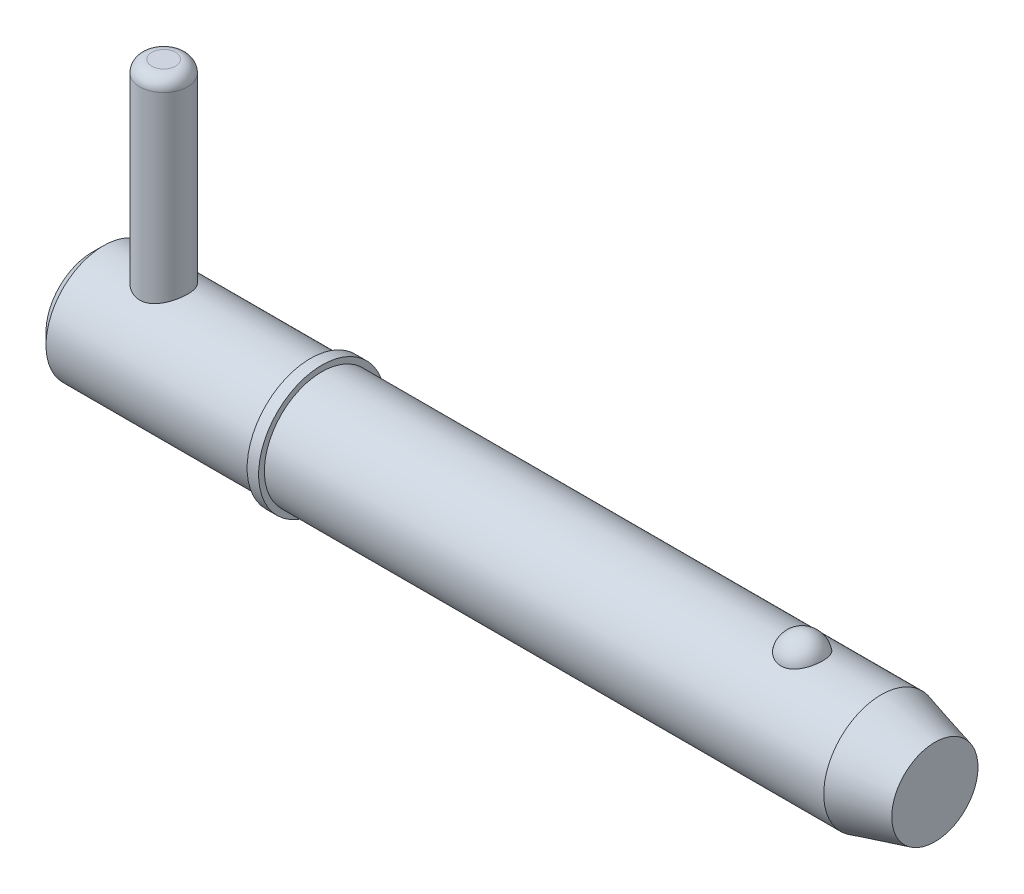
ISO-10303-21;
HEADER;
FILE_DESCRIPTION(('STEP AP214'),'2;1');
FILE_NAME('part.step','',(''),(''),'','','');
FILE_SCHEMA(('AUTOMOTIVE_DESIGN { 1 0 10303 214 1 1 1 1 }'));
ENDSEC;
DATA;
#1=APPLICATION_CONTEXT('core data for automotive mechanical design processes');
#2=APPLICATION_PROTOCOL_DEFINITION('international standard','automotive_design',2000,#1);
#3=PRODUCT_CONTEXT('',#1,'mechanical');
#4=PRODUCT('Part','Part','',(#3));
#5=PRODUCT_RELATED_PRODUCT_CATEGORY('part','',(#4));
#6=PRODUCT_DEFINITION_FORMATION('','',#4);
#7=PRODUCT_DEFINITION_CONTEXT('part definition',#1,'design');
#8=PRODUCT_DEFINITION('design','',#6,#7);
#9=PRODUCT_DEFINITION_SHAPE('','',#8);
#10=(LENGTH_UNIT() NAMED_UNIT(*) SI_UNIT(.MILLI.,.METRE.));
#11=(NAMED_UNIT(*) PLANE_ANGLE_UNIT() SI_UNIT($,.RADIAN.));
#12=(NAMED_UNIT(*) SI_UNIT($,.STERADIAN.) SOLID_ANGLE_UNIT());
#13=UNCERTAINTY_MEASURE_WITH_UNIT(LENGTH_MEASURE(1.E-05),#10,'distance_accuracy_value','');
#14=(GEOMETRIC_REPRESENTATION_CONTEXT(3) GLOBAL_UNCERTAINTY_ASSIGNED_CONTEXT((#13)) GLOBAL_UNIT_ASSIGNED_CONTEXT((#10,
#11,#12)) REPRESENTATION_CONTEXT('',''));
#15=CARTESIAN_POINT('',(0.,0.,0.));
#16=DIRECTION('',(0.,0.,1.));
#17=DIRECTION('',(1.,0.,0.));
#18=AXIS2_PLACEMENT_3D('',#15,#16,#17);
#19=CARTESIAN_POINT('',(5.94,20.635,0.));
#20=DIRECTION('',(0.,-1.,0.));
#21=DIRECTION('',(0.,0.,-1.));
#22=AXIS2_PLACEMENT_3D('',#19,#20,#21);
#23=CYLINDRICAL_SURFACE('',#22,1.98);
#24=CARTESIAN_POINT('',(5.94,-3.775,0.));
#25=DIRECTION('',(0.,1.,0.));
#26=DIRECTION('',(0.,0.,1.));
#27=AXIS2_PLACEMENT_3D('',#24,#25,#26);
#28=CIRCLE('',#27,1.98);
#29=CARTESIAN_POINT('',(5.94,-3.775,1.98));
#30=VERTEX_POINT('',#29);
#31=EDGE_CURVE('P0_E25',#30,#30,#28,.T.);
#32=ORIENTED_EDGE('',*,*,#31,.T.);
#33=EDGE_LOOP('',(#32));
#34=FACE_BOUND('',#33,.T.);
#35=CARTESIAN_POINT('',(5.94,19.645,0.));
#36=DIRECTION('',(0.,1.,0.));
#37=DIRECTION('',(0.,0.,1.));
#38=AXIS2_PLACEMENT_3D('',#35,#36,#37);
#39=CIRCLE('',#38,1.98);
#40=CARTESIAN_POINT('',(5.94,19.645,1.98));
#41=VERTEX_POINT('',#40);
#42=EDGE_CURVE('P0_E29',#41,#41,#39,.F.);
#43=ORIENTED_EDGE('',*,*,#42,.T.);
#44=EDGE_LOOP('',(#43));
#45=FACE_BOUND('',#44,.T.);
#46=ADVANCED_FACE('P0_F14',(#34,#45),#23,.T.);
#47=CARTESIAN_POINT('',(5.94,20.635,0.));
#48=DIRECTION('',(0.,1.,0.));
#49=DIRECTION('',(0.,0.,1.));
#50=AXIS2_PLACEMENT_3D('',#47,#48,#49);
#51=PLANE('',#50);
#52=CARTESIAN_POINT('',(5.94,20.635,0.));
#53=DIRECTION('',(0.,1.,0.));
#54=DIRECTION('',(0.,0.,1.));
#55=AXIS2_PLACEMENT_3D('',#52,#53,#54);
#56=CIRCLE('',#55,0.99);
#57=CARTESIAN_POINT('',(5.94,20.635,0.99));
#58=VERTEX_POINT('',#57);
#59=EDGE_CURVE('P0_E10',#58,#58,#56,.T.);
#60=ORIENTED_EDGE('',*,*,#59,.T.);
#61=EDGE_LOOP('',(#60));
#62=FACE_BOUND('',#61,.T.);
#63=ADVANCED_FACE('P0_F46',(#62),#51,.T.);
#64=CARTESIAN_POINT('',(5.94,-4.765,0.));
#65=DIRECTION('',(0.,1.,0.));
#66=DIRECTION('',(0.,0.,1.));
#67=AXIS2_PLACEMENT_3D('',#64,#65,#66);
#68=PLANE('',#67);
#69=CARTESIAN_POINT('',(5.94,-4.765,0.));
#70=DIRECTION('',(0.,1.,0.));
#71=DIRECTION('',(0.,0.,1.));
#72=AXIS2_PLACEMENT_3D('',#69,#70,#71);
#73=CIRCLE('',#72,0.99);
#74=CARTESIAN_POINT('',(5.94,-4.765,0.99));
#75=VERTEX_POINT('',#74);
#76=EDGE_CURVE('P0_E21',#75,#75,#73,.F.);
#77=ORIENTED_EDGE('',*,*,#76,.T.);
#78=EDGE_LOOP('',(#77));
#79=FACE_BOUND('',#78,.T.);
#80=ADVANCED_FACE('P0_F43',(#79),#68,.F.);
#81=CARTESIAN_POINT('',(5.94,-3.775,0.));
#82=DIRECTION('',(0.,1.,0.));
#83=DIRECTION('',(0.,0.,1.));
#84=AXIS2_PLACEMENT_3D('',#81,#82,#83);
#85=DEGENERATE_TOROIDAL_SURFACE('',#84,0.99,0.99,.T.);
#86=ORIENTED_EDGE('',*,*,#76,.F.);
#87=EDGE_LOOP('',(#86));
#88=FACE_BOUND('',#87,.T.);
#89=ORIENTED_EDGE('',*,*,#31,.F.);
#90=EDGE_LOOP('',(#89));
#91=FACE_BOUND('',#90,.T.);
#92=ADVANCED_FACE('P0_F38',(#88,#91),#85,.T.);
#93=CARTESIAN_POINT('',(5.94,19.645,0.));
#94=DIRECTION('',(0.,1.,0.));
#95=DIRECTION('',(0.,0.,1.));
#96=AXIS2_PLACEMENT_3D('',#93,#94,#95);
#97=DEGENERATE_TOROIDAL_SURFACE('',#96,0.99,0.99,.T.);
#98=ORIENTED_EDGE('',*,*,#42,.F.);
#99=EDGE_LOOP('',(#98));
#100=FACE_BOUND('',#99,.T.);
#101=ORIENTED_EDGE('',*,*,#59,.F.);
#102=EDGE_LOOP('',(#101));
#103=FACE_BOUND('',#102,.T.);
#104=ADVANCED_FACE('P0_F16',(#100,#103),#97,.T.);
#105=CLOSED_SHELL('',(#46,#63,#80,#92,#104));
#106=MANIFOLD_SOLID_BREP('P0_B1',#105);
#107=CARTESIAN_POINT('',(0.,0.,0.));
#108=DIRECTION('',(1.,0.,0.));
#109=DIRECTION('',(0.,0.,-1.));
#110=AXIS2_PLACEMENT_3D('',#107,#108,#109);
#111=CYLINDRICAL_SURFACE('',#110,4.765);
#112=CARTESIAN_POINT('',(65.4041944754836,0.,0.));
#113=DIRECTION('',(1.,0.,0.));
#114=DIRECTION('',(0.,0.,-1.));
#115=AXIS2_PLACEMENT_3D('',#112,#113,#114);
#116=CIRCLE('',#115,4.765);
#117=CARTESIAN_POINT('',(65.4041944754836,0.,-4.765));
#118=VERTEX_POINT('',#117);
#119=EDGE_CURVE('P1_E81',#118,#118,#116,.T.);
#120=ORIENTED_EDGE('',*,*,#119,.F.);
#121=EDGE_LOOP('',(#120));
#122=FACE_BOUND('',#121,.T.);
#123=CARTESIAN_POINT('',(19.05,0.,0.));
#124=DIRECTION('',(1.,0.,0.));
#125=DIRECTION('',(0.,0.,-1.));
#126=AXIS2_PLACEMENT_3D('',#123,#124,#125);
#127=CIRCLE('',#126,4.765);
#128=CARTESIAN_POINT('',(19.05,0.,-4.765));
#129=VERTEX_POINT('',#128);
#130=EDGE_CURVE('P1_E85',#129,#129,#127,.T.);
#131=ORIENTED_EDGE('',*,*,#130,.T.);
#132=EDGE_LOOP('',(#131));
#133=FACE_BOUND('',#132,.T.);
#134=CARTESIAN_POINT('',(58.851020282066,4.42764777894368,1.76101111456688));
#135=CARTESIAN_POINT('',(58.7597212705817,4.42764470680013,1.76101422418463));
#136=CARTESIAN_POINT('',(58.6684468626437,4.43059091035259,1.75366340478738));
#137=CARTESIAN_POINT('',(58.4886154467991,4.44201846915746,1.72451180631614));
#138=CARTESIAN_POINT('',(58.4000577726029,4.45049845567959,1.70271460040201));
#139=CARTESIAN_POINT('',(58.2282570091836,4.47200516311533,1.64539370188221));
#140=CARTESIAN_POINT('',(58.1450064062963,4.48502527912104,1.60988994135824));
#141=CARTESIAN_POINT('',(57.9857633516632,4.51419542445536,1.52617873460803));
#142=CARTESIAN_POINT('',(57.9097723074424,4.53034605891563,1.47796883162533));
#143=CARTESIAN_POINT('',(57.7647445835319,4.5645931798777,1.36860494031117));
#144=CARTESIAN_POINT('',(57.6959645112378,4.58273170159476,1.3071242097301));
#145=CARTESIAN_POINT('',(57.5693423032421,4.61870302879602,1.17370204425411));
#146=CARTESIAN_POINT('',(57.5115021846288,4.63653577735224,1.10175868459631));
#147=CARTESIAN_POINT('',(57.4055709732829,4.67090140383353,0.945806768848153));
#148=CARTESIAN_POINT('',(57.3580305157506,4.68734068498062,0.861402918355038));
#149=CARTESIAN_POINT('',(57.2770817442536,4.71628466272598,0.685442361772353));
#150=CARTESIAN_POINT('',(57.2436747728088,4.72878898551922,0.593884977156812));
#151=CARTESIAN_POINT('',(57.191287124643,4.74874061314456,0.404781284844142));
#152=CARTESIAN_POINT('',(57.1725178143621,4.75611366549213,0.307168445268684));
#153=CARTESIAN_POINT('',(57.1505846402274,4.76475393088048,0.109940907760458));
#154=CARTESIAN_POINT('',(57.1474205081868,4.76602124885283,0.0103262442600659));
#155=CARTESIAN_POINT('',(57.1567405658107,4.76232928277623,-0.187629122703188));
#156=CARTESIAN_POINT('',(57.1691588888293,4.7573962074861,-0.285973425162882));
#157=CARTESIAN_POINT('',(57.2092804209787,4.74184975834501,-0.479027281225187));
#158=CARTESIAN_POINT('',(57.2369839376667,4.7312362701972,-0.573736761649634));
#159=CARTESIAN_POINT('',(57.3071581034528,4.70540026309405,-0.756973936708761));
#160=CARTESIAN_POINT('',(57.3496460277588,4.69017235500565,-0.845494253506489));
#161=CARTESIAN_POINT('',(57.448520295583,4.6566986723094,-1.01378033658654));
#162=CARTESIAN_POINT('',(57.5049076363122,4.63845268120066,-1.09354547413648));
#163=CARTESIAN_POINT('',(57.630552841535,4.60085438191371,-1.24228523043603));
#164=CARTESIAN_POINT('',(57.6998439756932,4.58149930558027,-1.31123108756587));
#165=CARTESIAN_POINT('',(57.8496066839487,4.54391653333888,-1.43607409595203));
#166=CARTESIAN_POINT('',(57.9300771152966,4.52568872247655,-1.49197257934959));
#167=CARTESIAN_POINT('',(58.0981500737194,4.49293007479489,-1.58786764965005));
#168=CARTESIAN_POINT('',(58.1855445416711,4.47832346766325,-1.62820219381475));
#169=CARTESIAN_POINT('',(58.366553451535,4.45406011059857,-1.69345757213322));
#170=CARTESIAN_POINT('',(58.4601655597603,4.44440151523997,-1.71838415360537));
#171=CARTESIAN_POINT('',(58.6458939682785,4.43159888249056,-1.75112843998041));
#172=CARTESIAN_POINT('',(58.737849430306,4.42815213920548,-1.75974223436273));
#173=CARTESIAN_POINT('',(58.9219658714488,4.427247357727,-1.76201865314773));
#174=CARTESIAN_POINT('',(59.0141268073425,4.42978816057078,-1.7556841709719));
#175=CARTESIAN_POINT('',(59.1931292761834,4.4403864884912,-1.72869560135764));
#176=CARTESIAN_POINT('',(59.2800474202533,4.44827555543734,-1.70847853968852));
#177=CARTESIAN_POINT('',(59.4491314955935,4.46852246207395,-1.65479562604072));
#178=CARTESIAN_POINT('',(59.5312970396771,4.48088066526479,-1.62132869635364));
#179=CARTESIAN_POINT('',(59.6905916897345,4.50907357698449,-1.54120560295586));
#180=CARTESIAN_POINT('',(59.7675700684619,4.52497884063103,-1.49427526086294));
#181=CARTESIAN_POINT('',(59.9127080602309,4.55845148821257,-1.38881222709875));
#182=CARTESIAN_POINT('',(59.9808656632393,4.57601924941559,-1.33027689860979));
#183=CARTESIAN_POINT('',(60.1100990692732,4.61196537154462,-1.19991049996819));
#184=CARTESIAN_POINT('',(60.1706562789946,4.63034074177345,-1.12756415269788));
#185=CARTESIAN_POINT('',(60.2792797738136,4.66513959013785,-0.973612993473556));
#186=CARTESIAN_POINT('',(60.3273438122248,4.68156271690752,-0.8920065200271));
#187=CARTESIAN_POINT('',(60.411383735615,4.71130224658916,-0.718892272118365));
#188=CARTESIAN_POINT('',(60.4469185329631,4.724501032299,-0.627149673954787));
#189=CARTESIAN_POINT('',(60.5029522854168,4.74571823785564,-0.438611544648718));
#190=CARTESIAN_POINT('',(60.523450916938,4.75373654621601,-0.341815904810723));
#191=CARTESIAN_POINT('',(60.5490338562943,4.76378905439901,-0.145633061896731));
#192=CARTESIAN_POINT('',(60.554076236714,4.76580697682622,-0.046239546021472));
#193=CARTESIAN_POINT('',(60.5485239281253,4.76360573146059,0.15203857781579));
#194=CARTESIAN_POINT('',(60.5379294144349,4.75938663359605,0.250923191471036));
#195=CARTESIAN_POINT('',(60.5013875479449,4.74516937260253,0.445004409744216));
#196=CARTESIAN_POINT('',(60.4754964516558,4.73519238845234,0.540213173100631));
#197=CARTESIAN_POINT('',(60.4089273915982,4.7104939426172,0.724662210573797));
#198=CARTESIAN_POINT('',(60.368248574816,4.69577220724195,0.81390214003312));
#199=CARTESIAN_POINT('',(60.2727177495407,4.66303767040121,0.984313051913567));
#200=CARTESIAN_POINT('',(60.2178042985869,4.64501070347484,1.06544688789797));
#201=CARTESIAN_POINT('',(60.0950496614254,4.60764678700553,1.21692673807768));
#202=CARTESIAN_POINT('',(60.0272086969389,4.58830985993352,1.2872729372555));
#203=CARTESIAN_POINT('',(59.8805480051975,4.55060370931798,1.41479271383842));
#204=CARTESIAN_POINT('',(59.8017918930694,4.53222967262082,1.47203785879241));
#205=CARTESIAN_POINT('',(59.6349890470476,4.49849576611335,1.57212016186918));
#206=CARTESIAN_POINT('',(59.5469417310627,4.48313608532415,1.61495641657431));
#207=CARTESIAN_POINT('',(59.3597918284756,4.45676184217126,1.68642657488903));
#208=CARTESIAN_POINT('',(59.2603653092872,4.44598302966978,1.71430590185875));
#209=CARTESIAN_POINT('',(59.0576210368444,4.43142918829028,1.7515925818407));
#210=CARTESIAN_POINT('',(58.9543049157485,4.42765125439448,1.76100759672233));
#211=CARTESIAN_POINT('',(58.851020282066,4.42764777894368,1.76101111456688));
#212=B_SPLINE_CURVE_WITH_KNOTS('',3,(#134,#135,#136,#137,#138,#139,#140,#141,#142,#143,#144,
#145,#146,#147,#148,#149,#150,#151,#152,#153,#154,#155,#156,#157,#158,#159,#160,#161,#162,#163,
#164,#165,#166,#167,#168,#169,#170,#171,#172,#173,#174,#175,#176,#177,#178,#179,#180,#181,#182,
#183,#184,#185,#186,#187,#188,#189,#190,#191,#192,#193,#194,#195,#196,#197,#198,#199,#200,#201,
#202,#203,#204,#205,#206,#207,#208,#209,#210,#211),.UNSPECIFIED.,.T.,.F.,(4,2,2,2,2,2,2,2,2,2,2,
2,2,2,2,2,2,2,2,2,2,2,2,2,2,2,2,2,2,2,2,2,2,2,2,2,2,2,4),(0.,0.273517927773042,
0.546968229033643,0.820022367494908,1.09312934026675,1.37393946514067,1.65480131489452,
1.94820420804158,2.24163496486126,2.53922817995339,2.8368162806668,3.13315071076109,
3.42949110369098,3.72617893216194,4.02288805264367,4.32037303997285,4.61782764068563,
4.90840095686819,5.19886582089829,5.4747485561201,5.75057789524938,6.01809977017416,
6.28564340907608,6.55907787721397,6.83257454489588,7.11962987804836,7.40673679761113,
7.70312663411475,7.99952284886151,8.29672237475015,8.59391856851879,8.89002850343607,
9.18615552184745,9.483582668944,9.78100471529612,10.0767610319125,10.3725358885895,
10.6820893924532,10.991514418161),.UNSPECIFIED.);
#213=CARTESIAN_POINT('',(58.851020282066,4.42764777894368,1.76101111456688));
#214=VERTEX_POINT('',#213);
#215=EDGE_CURVE('P1_E35',#214,#214,#212,.T.);
#216=ORIENTED_EDGE('',*,*,#215,.T.);
#217=EDGE_LOOP('',(#216));
#218=FACE_BOUND('',#217,.T.);
#219=ADVANCED_FACE('P1_F13',(#122,#133,#218),#111,.T.);
#220=CARTESIAN_POINT('',(0.,0.,0.));
#221=DIRECTION('',(-1.,0.,0.));
#222=DIRECTION('',(0.,0.,1.));
#223=AXIS2_PLACEMENT_3D('',#220,#221,#222);
#224=PLANE('',#223);
#225=CARTESIAN_POINT('',(0.,0.,0.));
#226=DIRECTION('',(1.,0.,0.));
#227=DIRECTION('',(0.,0.,-1.));
#228=AXIS2_PLACEMENT_3D('',#225,#226,#227);
#229=CIRCLE('',#228,3.812);
#230=CARTESIAN_POINT('',(0.,0.,-3.812));
#231=VERTEX_POINT('',#230);
#232=EDGE_CURVE('P1_E9',#231,#231,#229,.T.);
#233=ORIENTED_EDGE('',*,*,#232,.F.);
#234=EDGE_LOOP('',(#233));
#235=FACE_BOUND('',#234,.T.);
#236=ADVANCED_FACE('P1_F15',(#235),#224,.T.);
#237=CARTESIAN_POINT('',(0.952999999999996,0.,0.));
#238=DIRECTION('',(1.,0.,0.));
#239=DIRECTION('',(0.,0.,-1.));
#240=AXIS2_PLACEMENT_3D('',#237,#238,#239);
#241=CONICAL_SURFACE('',#240,4.765,0.78539816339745);
#242=ORIENTED_EDGE('',*,*,#232,.T.);
#243=EDGE_LOOP('',(#242));
#244=FACE_BOUND('',#243,.T.);
#245=CARTESIAN_POINT('',(0.952999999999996,0.,0.));
#246=DIRECTION('',(1.,0.,0.));
#247=DIRECTION('',(0.,0.,-1.));
#248=AXIS2_PLACEMENT_3D('',#245,#246,#247);
#249=CIRCLE('',#248,4.765);
#250=CARTESIAN_POINT('',(0.952999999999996,0.,-4.765));
#251=VERTEX_POINT('',#250);
#252=EDGE_CURVE('P1_E26',#251,#251,#249,.T.);
#253=ORIENTED_EDGE('',*,*,#252,.F.);
#254=EDGE_LOOP('',(#253));
#255=FACE_BOUND('',#254,.T.);
#256=ADVANCED_FACE('P1_F77',(#244,#255),#241,.T.);
#257=CARTESIAN_POINT('',(0.,0.,0.));
#258=DIRECTION('',(1.,0.,0.));
#259=DIRECTION('',(0.,0.,-1.));
#260=AXIS2_PLACEMENT_3D('',#257,#258,#259);
#261=CYLINDRICAL_SURFACE('',#260,4.765);
#262=CARTESIAN_POINT('',(5.94,-4.33414639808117,1.98));
#263=CARTESIAN_POINT('',(5.83435484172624,-4.33415447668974,1.97999169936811));
#264=CARTESIAN_POINT('',(5.72854887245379,-4.33806396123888,1.97149330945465));
#265=CARTESIAN_POINT('',(5.51998191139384,-4.35319906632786,1.93783487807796));
#266=CARTESIAN_POINT('',(5.41723000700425,-4.3644446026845,1.91262947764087));
#267=CARTESIAN_POINT('',(5.21817294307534,-4.39274225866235,1.84670269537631));
#268=CARTESIAN_POINT('',(5.12184344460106,-4.40977076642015,1.80604432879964));
#269=CARTESIAN_POINT('',(4.93740039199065,-4.44768106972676,1.71055160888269));
#270=CARTESIAN_POINT('',(4.84928487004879,-4.46856193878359,1.65572066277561));
#271=CARTESIAN_POINT('',(4.67826533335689,-4.51326966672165,1.52981120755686));
#272=CARTESIAN_POINT('',(4.59593118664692,-4.53719608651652,1.45799365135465));
#273=CARTESIAN_POINT('',(4.44405452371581,-4.58448035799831,1.30170177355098));
#274=CARTESIAN_POINT('',(4.37451692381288,-4.60783798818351,1.21722260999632));
#275=CARTESIAN_POINT('',(4.24730683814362,-4.65256187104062,1.03353484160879));
#276=CARTESIAN_POINT('',(4.19027484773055,-4.67379892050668,0.933848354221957));
#277=CARTESIAN_POINT('',(4.0940363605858,-4.7106711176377,0.7252544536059));
#278=CARTESIAN_POINT('',(4.05482199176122,-4.72630873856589,0.61635113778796));
#279=CARTESIAN_POINT('',(3.99739515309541,-4.74951416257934,0.398397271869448));
#280=CARTESIAN_POINT('',(3.97820018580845,-4.7574579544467,0.289646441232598));
#281=CARTESIAN_POINT('',(3.95818309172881,-4.76574596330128,0.0701967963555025));
#282=CARTESIAN_POINT('',(3.95735355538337,-4.76609324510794,-0.0405012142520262));
#283=CARTESIAN_POINT('',(3.9735743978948,-4.75937098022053,-0.253561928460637));
#284=CARTESIAN_POINT('',(3.98954548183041,-4.75274912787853,-0.356023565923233));
#285=CARTESIAN_POINT('',(4.03706504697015,-4.73344665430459,-0.556659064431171));
#286=CARTESIAN_POINT('',(4.06861467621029,-4.72076558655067,-0.654832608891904));
#287=CARTESIAN_POINT('',(4.14677192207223,-4.69032846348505,-0.845904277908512));
#288=CARTESIAN_POINT('',(4.19360181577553,-4.67249797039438,-0.938699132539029));
#289=CARTESIAN_POINT('',(4.30077315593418,-4.63350852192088,-1.11535616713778));
#290=CARTESIAN_POINT('',(4.3611193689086,-4.61234839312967,-1.19921518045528));
#291=CARTESIAN_POINT('',(4.49853487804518,-4.56707259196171,-1.3618711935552));
#292=CARTESIAN_POINT('',(4.57648039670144,-4.5428537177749,-1.43990029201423));
#293=CARTESIAN_POINT('',(4.74440779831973,-4.49530722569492,-1.58211009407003));
#294=CARTESIAN_POINT('',(4.83439425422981,-4.47197995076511,-1.64628551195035));
#295=CARTESIAN_POINT('',(5.02755026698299,-4.42812342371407,-1.76092221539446));
#296=CARTESIAN_POINT('',(5.13105348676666,-4.40770990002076,-1.81086937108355));
#297=CARTESIAN_POINT('',(5.34607555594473,-4.37336901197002,-1.89231211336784));
#298=CARTESIAN_POINT('',(5.45758864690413,-4.3594370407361,-1.92382080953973));
#299=CARTESIAN_POINT('',(5.67777275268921,-4.34077746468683,-1.96554536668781));
#300=CARTESIAN_POINT('',(5.78616167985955,-4.33551319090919,-1.9770057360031));
#301=CARTESIAN_POINT('',(6.00341835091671,-4.33325118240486,-1.98196183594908));
#302=CARTESIAN_POINT('',(6.11228591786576,-4.33625061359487,-1.97546372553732));
#303=CARTESIAN_POINT('',(6.32012423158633,-4.34962383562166,-1.94582288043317));
#304=CARTESIAN_POINT('',(6.41928436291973,-4.35951709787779,-1.92376364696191));
#305=CARTESIAN_POINT('',(6.61241543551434,-4.38495043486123,-1.86506038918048));
#306=CARTESIAN_POINT('',(6.70638516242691,-4.40049182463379,-1.82841296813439));
#307=CARTESIAN_POINT('',(6.89090272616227,-4.43627016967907,-1.73985559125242));
#308=CARTESIAN_POINT('',(6.98113841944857,-4.45667771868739,-1.68736639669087));
#309=CARTESIAN_POINT('',(7.1519532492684,-4.49964530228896,-1.56919282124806));
#310=CARTESIAN_POINT('',(7.232528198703,-4.52220626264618,-1.50350275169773));
#311=CARTESIAN_POINT('',(7.38851617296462,-4.56914071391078,-1.35452895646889));
#312=CARTESIAN_POINT('',(7.46298462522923,-4.5935132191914,-1.27025197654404));
#313=CARTESIAN_POINT('',(7.59689029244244,-4.63962841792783,-1.08983181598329));
#314=CARTESIAN_POINT('',(7.65632644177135,-4.66137092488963,-0.993687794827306));
#315=CARTESIAN_POINT('',(7.75840361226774,-4.69991192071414,-0.791608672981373));
#316=CARTESIAN_POINT('',(7.80100481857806,-4.71669866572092,-0.685651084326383));
#317=CARTESIAN_POINT('',(7.86746997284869,-4.74331408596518,-0.467197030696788));
#318=CARTESIAN_POINT('',(7.8913450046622,-4.75314687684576,-0.354704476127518));
#319=CARTESIAN_POINT('',(7.91828971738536,-4.76427543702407,-0.134819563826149));
#320=CARTESIAN_POINT('',(7.92269147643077,-4.76611762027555,-0.027616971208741));
#321=CARTESIAN_POINT('',(7.91414154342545,-4.76256684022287,0.185959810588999));
#322=CARTESIAN_POINT('',(7.90119286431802,-4.75717513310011,0.292334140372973));
#323=CARTESIAN_POINT('',(7.85926572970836,-4.74004856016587,0.497383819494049));
#324=CARTESIAN_POINT('',(7.83086647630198,-4.72854322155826,0.596198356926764));
#325=CARTESIAN_POINT('',(7.75947503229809,-4.70045111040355,0.787624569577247));
#326=CARTESIAN_POINT('',(7.71648006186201,-4.68386336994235,0.880235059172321));
#327=CARTESIAN_POINT('',(7.6149456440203,-4.64628321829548,1.06122875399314));
#328=CARTESIAN_POINT('',(7.55579211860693,-4.62512577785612,1.14923242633));
#329=CARTESIAN_POINT('',(7.42451813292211,-4.58091700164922,1.31443888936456));
#330=CARTESIAN_POINT('',(7.35239289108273,-4.5578649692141,1.39163767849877));
#331=CARTESIAN_POINT('',(7.19146107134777,-4.51050832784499,1.53847013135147));
#332=CARTESIAN_POINT('',(7.10185635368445,-4.48622440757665,1.60723941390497));
#333=CARTESIAN_POINT('',(6.91164948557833,-4.44076541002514,1.72888900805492));
#334=CARTESIAN_POINT('',(6.81104124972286,-4.41959206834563,1.78176046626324));
#335=CARTESIAN_POINT('',(6.60181953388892,-4.38318936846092,1.86953227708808));
#336=CARTESIAN_POINT('',(6.49325511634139,-4.3679267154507,1.90453365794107));
#337=CARTESIAN_POINT('',(6.32681512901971,-4.35102038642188,1.94268459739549));
#338=CARTESIAN_POINT('',(6.27079191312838,-4.34638447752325,1.953006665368));
#339=CARTESIAN_POINT('',(6.15793999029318,-4.33925923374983,1.96879053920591));
#340=CARTESIAN_POINT('',(6.10111188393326,-4.33676837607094,1.97425579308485));
#341=CARTESIAN_POINT('',(6.00947316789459,-4.33456308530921,1.97908711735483));
#342=CARTESIAN_POINT('',(5.97474528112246,-4.33414374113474,1.98000272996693));
#343=CARTESIAN_POINT('',(5.94,-4.33414639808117,1.98));
#344=B_SPLINE_CURVE_WITH_KNOTS('',3,(#262,#263,#264,#265,#266,#267,#268,#269,#270,#271,#272,
#273,#274,#275,#276,#277,#278,#279,#280,#281,#282,#283,#284,#285,#286,#287,#288,#289,#290,#291,
#292,#293,#294,#295,#296,#297,#298,#299,#300,#301,#302,#303,#304,#305,#306,#307,#308,#309,#310,
#311,#312,#313,#314,#315,#316,#317,#318,#319,#320,#321,#322,#323,#324,#325,#326,#327,#328,#329,
#330,#331,#332,#333,#334,#335,#336,#337,#338,#339,#340,#341,#342,#343),.UNSPECIFIED.,.T.,.F.,(4,
2,2,2,2,2,2,2,2,2,2,2,2,2,2,2,2,2,2,2,2,2,2,2,2,2,2,2,2,2,2,2,2,2,2,2,2,2,2,2,4),(0.,
0.316814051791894,0.634491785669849,0.950887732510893,1.2672076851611,1.60127705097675,
1.93547449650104,2.28407463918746,2.63252061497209,2.96292077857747,3.29318763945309,
3.60346227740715,3.91375978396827,4.22878888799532,4.54392926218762,4.88117914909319,
5.21855748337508,5.56691259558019,5.91501972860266,6.24062939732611,6.56612741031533,
6.87094948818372,7.17584258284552,7.49361276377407,7.81152017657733,8.15513975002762,
8.4987836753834,8.8432355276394,9.18748334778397,9.50777781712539,9.8280166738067,
10.1370037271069,10.4460496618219,10.7690461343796,11.0921619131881,11.4371238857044,
11.7822776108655,12.1254577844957,12.2967183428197,12.4678572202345,12.5720531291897),.UNSPECIFIED.);
#345=CARTESIAN_POINT('',(5.94,-4.33414639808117,1.98));
#346=VERTEX_POINT('',#345);
#347=EDGE_CURVE('P1_E17',#346,#346,#344,.T.);
#348=ORIENTED_EDGE('',*,*,#347,.F.);
#349=EDGE_LOOP('',(#348));
#350=FACE_BOUND('',#349,.T.);
#351=CARTESIAN_POINT('',(5.94,4.33414639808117,1.98));
#352=CARTESIAN_POINT('',(6.04564515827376,4.33415447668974,1.97999169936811));
#353=CARTESIAN_POINT('',(6.15145112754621,4.33806396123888,1.97149330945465));
#354=CARTESIAN_POINT('',(6.36001808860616,4.35319906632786,1.93783487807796));
#355=CARTESIAN_POINT('',(6.46276999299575,4.3644446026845,1.91262947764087));
#356=CARTESIAN_POINT('',(6.66182705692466,4.39274225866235,1.84670269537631));
#357=CARTESIAN_POINT('',(6.75815655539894,4.40977076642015,1.80604432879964));
#358=CARTESIAN_POINT('',(6.94259960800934,4.44768106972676,1.71055160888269));
#359=CARTESIAN_POINT('',(7.03071512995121,4.46856193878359,1.65572066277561));
#360=CARTESIAN_POINT('',(7.20173466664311,4.51326966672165,1.52981120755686));
#361=CARTESIAN_POINT('',(7.28406881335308,4.53719608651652,1.45799365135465));
#362=CARTESIAN_POINT('',(7.43594547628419,4.58448035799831,1.30170177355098));
#363=CARTESIAN_POINT('',(7.50548307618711,4.60783798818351,1.21722260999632));
#364=CARTESIAN_POINT('',(7.63269316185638,4.65256187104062,1.03353484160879));
#365=CARTESIAN_POINT('',(7.68972515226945,4.67379892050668,0.933848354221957));
#366=CARTESIAN_POINT('',(7.7859636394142,4.7106711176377,0.7252544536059));
#367=CARTESIAN_POINT('',(7.82517800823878,4.72630873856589,0.61635113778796));
#368=CARTESIAN_POINT('',(7.88260484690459,4.74951416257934,0.398397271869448));
#369=CARTESIAN_POINT('',(7.90179981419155,4.7574579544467,0.289646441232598));
#370=CARTESIAN_POINT('',(7.92181690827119,4.76574596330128,0.0701967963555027));
#371=CARTESIAN_POINT('',(7.92264644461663,4.76609324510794,-0.040501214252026));
#372=CARTESIAN_POINT('',(7.9064256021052,4.75937098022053,-0.253561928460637));
#373=CARTESIAN_POINT('',(7.89045451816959,4.75274912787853,-0.356023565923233));
#374=CARTESIAN_POINT('',(7.84293495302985,4.73344665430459,-0.55665906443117));
#375=CARTESIAN_POINT('',(7.81138532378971,4.72076558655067,-0.654832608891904));
#376=CARTESIAN_POINT('',(7.73322807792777,4.69032846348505,-0.845904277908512));
#377=CARTESIAN_POINT('',(7.68639818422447,4.67249797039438,-0.938699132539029));
#378=CARTESIAN_POINT('',(7.57922684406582,4.63350852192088,-1.11535616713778));
#379=CARTESIAN_POINT('',(7.5188806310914,4.61234839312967,-1.19921518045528));
#380=CARTESIAN_POINT('',(7.38146512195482,4.56707259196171,-1.3618711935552));
#381=CARTESIAN_POINT('',(7.30351960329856,4.5428537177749,-1.43990029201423));
#382=CARTESIAN_POINT('',(7.13559220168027,4.49530722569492,-1.58211009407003));
#383=CARTESIAN_POINT('',(7.04560574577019,4.47197995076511,-1.64628551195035));
#384=CARTESIAN_POINT('',(6.85244973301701,4.42812342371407,-1.76092221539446));
#385=CARTESIAN_POINT('',(6.74894651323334,4.40770990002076,-1.81086937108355));
#386=CARTESIAN_POINT('',(6.53392444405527,4.37336901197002,-1.89231211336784));
#387=CARTESIAN_POINT('',(6.42241135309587,4.3594370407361,-1.92382080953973));
#388=CARTESIAN_POINT('',(6.20222724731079,4.34077746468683,-1.96554536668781));
#389=CARTESIAN_POINT('',(6.09383832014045,4.33551319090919,-1.9770057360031));
#390=CARTESIAN_POINT('',(5.87658164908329,4.33325118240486,-1.98196183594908));
#391=CARTESIAN_POINT('',(5.76771408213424,4.33625061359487,-1.97546372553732));
#392=CARTESIAN_POINT('',(5.55987576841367,4.34962383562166,-1.94582288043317));
#393=CARTESIAN_POINT('',(5.46071563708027,4.35951709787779,-1.92376364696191));
#394=CARTESIAN_POINT('',(5.26758456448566,4.38495043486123,-1.86506038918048));
#395=CARTESIAN_POINT('',(5.17361483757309,4.40049182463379,-1.82841296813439));
#396=CARTESIAN_POINT('',(4.98909727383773,4.43627016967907,-1.73985559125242));
#397=CARTESIAN_POINT('',(4.89886158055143,4.45667771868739,-1.68736639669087));
#398=CARTESIAN_POINT('',(4.72804675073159,4.49964530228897,-1.56919282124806));
#399=CARTESIAN_POINT('',(4.647471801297,4.52220626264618,-1.50350275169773));
#400=CARTESIAN_POINT('',(4.49148382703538,4.56914071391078,-1.35452895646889));
#401=CARTESIAN_POINT('',(4.41701537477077,4.5935132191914,-1.27025197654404));
#402=CARTESIAN_POINT('',(4.28310970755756,4.63962841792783,-1.08983181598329));
#403=CARTESIAN_POINT('',(4.22367355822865,4.66137092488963,-0.993687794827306));
#404=CARTESIAN_POINT('',(4.12159638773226,4.69991192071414,-0.791608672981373));
#405=CARTESIAN_POINT('',(4.07899518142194,4.71669866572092,-0.685651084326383));
#406=CARTESIAN_POINT('',(4.01253002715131,4.74331408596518,-0.467197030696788));
#407=CARTESIAN_POINT('',(3.98865499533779,4.75314687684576,-0.354704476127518));
#408=CARTESIAN_POINT('',(3.96171028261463,4.76427543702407,-0.134819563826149));
#409=CARTESIAN_POINT('',(3.95730852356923,4.76611762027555,-0.0276169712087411));
#410=CARTESIAN_POINT('',(3.96585845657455,4.76256684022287,0.185959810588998));
#411=CARTESIAN_POINT('',(3.97880713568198,4.75717513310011,0.292334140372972));
#412=CARTESIAN_POINT('',(4.02073427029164,4.74004856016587,0.497383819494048));
#413=CARTESIAN_POINT('',(4.04913352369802,4.72854322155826,0.596198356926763));
#414=CARTESIAN_POINT('',(4.12052496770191,4.70045111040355,0.787624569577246));
#415=CARTESIAN_POINT('',(4.16351993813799,4.68386336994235,0.880235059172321));
#416=CARTESIAN_POINT('',(4.2650543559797,4.64628321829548,1.06122875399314));
#417=CARTESIAN_POINT('',(4.32420788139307,4.62512577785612,1.14923242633));
#418=CARTESIAN_POINT('',(4.45548186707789,4.58091700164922,1.31443888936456));
#419=CARTESIAN_POINT('',(4.52760710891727,4.5578649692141,1.39163767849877));
#420=CARTESIAN_POINT('',(4.68853892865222,4.51050832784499,1.53847013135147));
#421=CARTESIAN_POINT('',(4.77814364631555,4.48622440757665,1.60723941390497));
#422=CARTESIAN_POINT('',(4.96835051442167,4.44076541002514,1.72888900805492));
#423=CARTESIAN_POINT('',(5.06895875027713,4.41959206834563,1.78176046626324));
#424=CARTESIAN_POINT('',(5.27818046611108,4.38318936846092,1.86953227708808));
#425=CARTESIAN_POINT('',(5.38674488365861,4.3679267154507,1.90453365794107));
#426=CARTESIAN_POINT('',(5.55318487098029,4.35102038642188,1.94268459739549));
#427=CARTESIAN_POINT('',(5.60920808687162,4.34638447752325,1.953006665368));
#428=CARTESIAN_POINT('',(5.72206000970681,4.33925923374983,1.96879053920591));
#429=CARTESIAN_POINT('',(5.77888811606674,4.33676837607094,1.97425579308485));
#430=CARTESIAN_POINT('',(5.87052683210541,4.33456308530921,1.97908711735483));
#431=CARTESIAN_POINT('',(5.90525471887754,4.33414374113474,1.98000272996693));
#432=CARTESIAN_POINT('',(5.94,4.33414639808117,1.98));
#433=B_SPLINE_CURVE_WITH_KNOTS('',3,(#351,#352,#353,#354,#355,#356,#357,#358,#359,#360,#361,
#362,#363,#364,#365,#366,#367,#368,#369,#370,#371,#372,#373,#374,#375,#376,#377,#378,#379,#380,
#381,#382,#383,#384,#385,#386,#387,#388,#389,#390,#391,#392,#393,#394,#395,#396,#397,#398,#399,
#400,#401,#402,#403,#404,#405,#406,#407,#408,#409,#410,#411,#412,#413,#414,#415,#416,#417,#418,
#419,#420,#421,#422,#423,#424,#425,#426,#427,#428,#429,#430,#431,#432),.UNSPECIFIED.,.T.,.F.,(4,
2,2,2,2,2,2,2,2,2,2,2,2,2,2,2,2,2,2,2,2,2,2,2,2,2,2,2,2,2,2,2,2,2,2,2,2,2,2,2,4),(0.,
0.316814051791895,0.634491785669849,0.950887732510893,1.2672076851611,1.60127705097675,
1.93547449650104,2.28407463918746,2.63252061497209,2.96292077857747,3.29318763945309,
3.60346227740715,3.91375978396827,4.22878888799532,4.54392926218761,4.88117914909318,
5.21855748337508,5.56691259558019,5.91501972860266,6.24062939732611,6.56612741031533,
6.87094948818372,7.17584258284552,7.49361276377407,7.81152017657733,8.15513975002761,
8.4987836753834,8.84323552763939,9.18748334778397,9.50777781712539,9.8280166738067,
10.1370037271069,10.4460496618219,10.7690461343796,11.0921619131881,11.4371238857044,
11.7822776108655,12.1254577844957,12.2967183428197,12.4678572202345,12.5720531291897),.UNSPECIFIED.);
#434=CARTESIAN_POINT('',(5.94,4.33414639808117,1.98));
#435=VERTEX_POINT('',#434);
#436=EDGE_CURVE('P1_E43',#435,#435,#433,.T.);
#437=ORIENTED_EDGE('',*,*,#436,.F.);
#438=EDGE_LOOP('',(#437));
#439=FACE_BOUND('',#438,.T.);
#440=ORIENTED_EDGE('',*,*,#252,.T.);
#441=EDGE_LOOP('',(#440));
#442=FACE_BOUND('',#441,.T.);
#443=CARTESIAN_POINT('',(18.097,0.,0.));
#444=DIRECTION('',(1.,0.,0.));
#445=DIRECTION('',(0.,0.,-1.));
#446=AXIS2_PLACEMENT_3D('',#443,#444,#445);
#447=CIRCLE('',#446,4.765);
#448=CARTESIAN_POINT('',(18.097,0.,-4.765));
#449=VERTEX_POINT('',#448);
#450=EDGE_CURVE('P1_E31',#449,#449,#447,.T.);
#451=ORIENTED_EDGE('',*,*,#450,.F.);
#452=EDGE_LOOP('',(#451));
#453=FACE_BOUND('',#452,.T.);
#454=ADVANCED_FACE('P1_F103',(#350,#439,#442,#453),#261,.T.);
#455=CARTESIAN_POINT('',(18.097,4.765,0.));
#456=DIRECTION('',(-1.,0.,0.));
#457=DIRECTION('',(0.,0.,1.));
#458=AXIS2_PLACEMENT_3D('',#455,#456,#457);
#459=PLANE('',#458);
#460=ORIENTED_EDGE('',*,*,#450,.T.);
#461=EDGE_LOOP('',(#460));
#462=FACE_BOUND('',#461,.T.);
#463=CARTESIAN_POINT('',(18.097,0.,0.));
#464=DIRECTION('',(1.,0.,0.));
#465=DIRECTION('',(0.,0.,-1.));
#466=AXIS2_PLACEMENT_3D('',#463,#464,#465);
#467=CIRCLE('',#466,5.2415);
#468=CARTESIAN_POINT('',(18.097,0.,-5.2415));
#469=VERTEX_POINT('',#468);
#470=EDGE_CURVE('P1_E91',#469,#469,#467,.T.);
#471=ORIENTED_EDGE('',*,*,#470,.F.);
#472=EDGE_LOOP('',(#471));
#473=FACE_BOUND('',#472,.T.);
#474=ADVANCED_FACE('P1_F100',(#462,#473),#459,.T.);
#475=CARTESIAN_POINT('',(0.,0.,0.));
#476=DIRECTION('',(1.,0.,0.));
#477=DIRECTION('',(0.,0.,-1.));
#478=AXIS2_PLACEMENT_3D('',#475,#476,#477);
#479=CYLINDRICAL_SURFACE('',#478,5.2415);
#480=ORIENTED_EDGE('',*,*,#470,.T.);
#481=EDGE_LOOP('',(#480));
#482=FACE_BOUND('',#481,.T.);
#483=CARTESIAN_POINT('',(19.05,0.,0.));
#484=DIRECTION('',(1.,0.,0.));
#485=DIRECTION('',(0.,0.,-1.));
#486=AXIS2_PLACEMENT_3D('',#483,#484,#485);
#487=CIRCLE('',#486,5.2415);
#488=CARTESIAN_POINT('',(19.05,0.,-5.2415));
#489=VERTEX_POINT('',#488);
#490=EDGE_CURVE('P1_E88',#489,#489,#487,.T.);
#491=ORIENTED_EDGE('',*,*,#490,.F.);
#492=EDGE_LOOP('',(#491));
#493=FACE_BOUND('',#492,.T.);
#494=ADVANCED_FACE('P1_F68',(#482,#493),#479,.T.);
#495=CARTESIAN_POINT('',(19.05,5.2415,0.));
#496=DIRECTION('',(1.,0.,0.));
#497=DIRECTION('',(0.,0.,-1.));
#498=AXIS2_PLACEMENT_3D('',#495,#496,#497);
#499=PLANE('',#498);
#500=ORIENTED_EDGE('',*,*,#490,.T.);
#501=EDGE_LOOP('',(#500));
#502=FACE_BOUND('',#501,.T.);
#503=ORIENTED_EDGE('',*,*,#130,.F.);
#504=EDGE_LOOP('',(#503));
#505=FACE_BOUND('',#504,.T.);
#506=ADVANCED_FACE('P1_F62',(#502,#505),#499,.T.);
#507=CARTESIAN_POINT('',(69.85,0.,0.));
#508=DIRECTION('',(-1.,0.,0.));
#509=DIRECTION('',(0.,0.,1.));
#510=AXIS2_PLACEMENT_3D('',#507,#508,#509);
#511=CONICAL_SURFACE('',#510,3.57375000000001,0.26179938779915);
#512=ORIENTED_EDGE('',*,*,#119,.T.);
#513=EDGE_LOOP('',(#512));
#514=FACE_BOUND('',#513,.T.);
#515=CARTESIAN_POINT('',(69.85,0.,0.));
#516=DIRECTION('',(1.,0.,0.));
#517=DIRECTION('',(0.,0.,-1.));
#518=AXIS2_PLACEMENT_3D('',#515,#516,#517);
#519=CIRCLE('',#518,3.57375000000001);
#520=CARTESIAN_POINT('',(69.85,0.,-3.57375000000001));
#521=VERTEX_POINT('',#520);
#522=EDGE_CURVE('P1_E42',#521,#521,#519,.T.);
#523=ORIENTED_EDGE('',*,*,#522,.F.);
#524=EDGE_LOOP('',(#523));
#525=FACE_BOUND('',#524,.T.);
#526=ADVANCED_FACE('P1_F59',(#514,#525),#511,.T.);
#527=CARTESIAN_POINT('',(69.85,3.57375000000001,0.));
#528=DIRECTION('',(1.,0.,0.));
#529=DIRECTION('',(0.,0.,-1.));
#530=AXIS2_PLACEMENT_3D('',#527,#528,#529);
#531=PLANE('',#530);
#532=ORIENTED_EDGE('',*,*,#522,.T.);
#533=EDGE_LOOP('',(#532));
#534=FACE_BOUND('',#533,.T.);
#535=ADVANCED_FACE('P1_F55',(#534),#531,.T.);
#536=CARTESIAN_POINT('',(58.851020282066,4.2885,0.));
#537=DIRECTION('',(-1.,0.,0.));
#538=DIRECTION('',(0.,1.,0.));
#539=AXIS2_PLACEMENT_3D('',#536,#537,#538);
#540=SPHERICAL_SURFACE('',#539,1.7665);
#541=ORIENTED_EDGE('',*,*,#215,.F.);
#542=EDGE_LOOP('',(#541));
#543=FACE_BOUND('',#542,.T.);
#544=ADVANCED_FACE('P1_F50',(#543),#540,.T.);
#545=CARTESIAN_POINT('',(5.94,-5.2415,0.));
#546=DIRECTION('',(0.,1.,0.));
#547=DIRECTION('',(0.,0.,1.));
#548=AXIS2_PLACEMENT_3D('',#545,#546,#547);
#549=CYLINDRICAL_SURFACE('',#548,1.98);
#550=ORIENTED_EDGE('',*,*,#347,.T.);
#551=EDGE_LOOP('',(#550));
#552=FACE_BOUND('',#551,.T.);
#553=ORIENTED_EDGE('',*,*,#436,.T.);
#554=EDGE_LOOP('',(#553));
#555=FACE_BOUND('',#554,.T.);
#556=ADVANCED_FACE('P1_F54',(#552,#555),#549,.F.);
#557=CLOSED_SHELL('',(#219,#236,#256,#454,#474,#494,#506,#526,#535,#544,#556));
#558=MANIFOLD_SOLID_BREP('P1_B1',#557);
#559=ADVANCED_BREP_SHAPE_REPRESENTATION('',(#18,#106,#558),#14);
#560=SHAPE_DEFINITION_REPRESENTATION(#9,#559);
ENDSEC;
END-ISO-10303-21;
